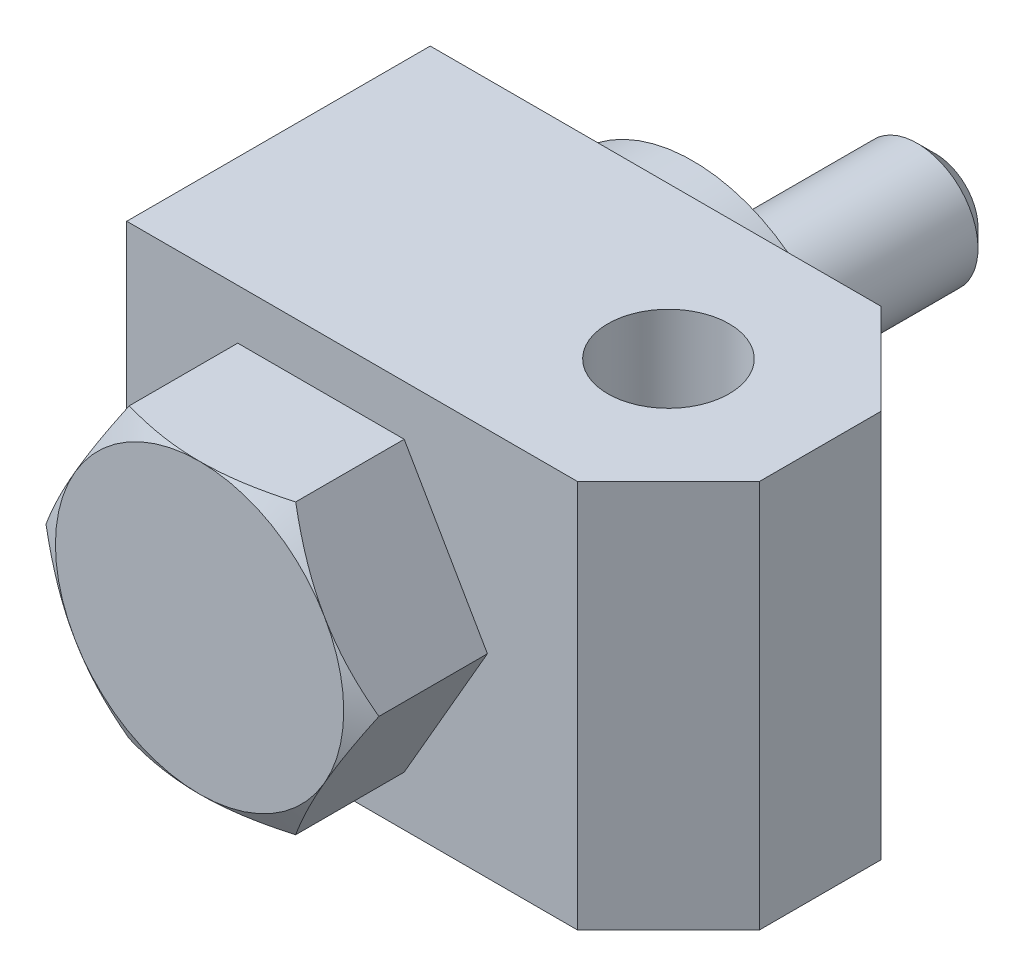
ISO-10303-21;
HEADER;
FILE_DESCRIPTION(('STEP AP214'),'2;1');
FILE_NAME('part.step','',(''),(''),'','','');
FILE_SCHEMA(('AUTOMOTIVE_DESIGN { 1 0 10303 214 1 1 1 1 }'));
ENDSEC;
DATA;
#1=APPLICATION_CONTEXT('core data for automotive mechanical design processes');
#2=APPLICATION_PROTOCOL_DEFINITION('international standard','automotive_design',2000,#1);
#3=PRODUCT_CONTEXT('',#1,'mechanical');
#4=PRODUCT('Part','Part','',(#3));
#5=PRODUCT_RELATED_PRODUCT_CATEGORY('part','',(#4));
#6=PRODUCT_DEFINITION_FORMATION('','',#4);
#7=PRODUCT_DEFINITION_CONTEXT('part definition',#1,'design');
#8=PRODUCT_DEFINITION('design','',#6,#7);
#9=PRODUCT_DEFINITION_SHAPE('','',#8);
#10=(LENGTH_UNIT() NAMED_UNIT(*) SI_UNIT(.MILLI.,.METRE.));
#11=(NAMED_UNIT(*) PLANE_ANGLE_UNIT() SI_UNIT($,.RADIAN.));
#12=(NAMED_UNIT(*) SI_UNIT($,.STERADIAN.) SOLID_ANGLE_UNIT());
#13=UNCERTAINTY_MEASURE_WITH_UNIT(LENGTH_MEASURE(1.E-05),#10,'distance_accuracy_value','');
#14=(GEOMETRIC_REPRESENTATION_CONTEXT(3) GLOBAL_UNCERTAINTY_ASSIGNED_CONTEXT((#13)) GLOBAL_UNIT_ASSIGNED_CONTEXT((#10,
#11,#12)) REPRESENTATION_CONTEXT('',''));
#15=CARTESIAN_POINT('',(0.,0.,0.));
#16=DIRECTION('',(0.,0.,1.));
#17=DIRECTION('',(1.,0.,0.));
#18=AXIS2_PLACEMENT_3D('',#15,#16,#17);
#19=CARTESIAN_POINT('',(0.,0.,-16.4));
#20=DIRECTION('',(0.,0.,1.));
#21=DIRECTION('',(0.,-1.,0.));
#22=AXIS2_PLACEMENT_3D('',#19,#20,#21);
#23=CYLINDRICAL_SURFACE('',#22,4.);
#24=CARTESIAN_POINT('',(0.,0.,-14.8));
#25=DIRECTION('',(0.,0.,-1.));
#26=DIRECTION('',(-1.,0.,0.));
#27=AXIS2_PLACEMENT_3D('',#24,#25,#26);
#28=CIRCLE('',#27,4.);
#29=CARTESIAN_POINT('',(-4.,0.,-14.8));
#30=VERTEX_POINT('',#29);
#31=EDGE_CURVE('E9',#30,#30,#28,.F.);
#32=ORIENTED_EDGE('',*,*,#31,.T.);
#33=EDGE_LOOP('',(#32));
#34=FACE_BOUND('',#33,.T.);
#35=CARTESIAN_POINT('',(0.,0.,0.));
#36=DIRECTION('',(0.,0.,1.));
#37=DIRECTION('',(0.,-1.,0.));
#38=AXIS2_PLACEMENT_3D('',#35,#36,#37);
#39=CIRCLE('',#38,4.);
#40=CARTESIAN_POINT('',(0.,-4.,0.));
#41=VERTEX_POINT('',#40);
#42=EDGE_CURVE('E294',#41,#41,#39,.F.);
#43=ORIENTED_EDGE('',*,*,#42,.T.);
#44=EDGE_LOOP('',(#43));
#45=FACE_BOUND('',#44,.T.);
#46=ADVANCED_FACE('F14',(#34,#45),#23,.T.);
#47=CARTESIAN_POINT('',(10.9696551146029,0.,-9.70548256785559));
#48=DIRECTION('',(0.866025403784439,0.5,0.));
#49=DIRECTION('',(-0.5,0.866025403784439,0.));
#50=AXIS2_PLACEMENT_3D('',#47,#48,#49);
#51=PLANE('',#50);
#52=DIRECTION('',(0.,0.,1.));
#53=VECTOR('',#52,1.);
#54=CARTESIAN_POINT('',(5.48482755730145,9.5,-9.70548256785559));
#55=LINE('',#54,#53);
#56=CARTESIAN_POINT('',(5.48482755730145,9.5,24.5));
#57=VERTEX_POINT('',#56);
#58=CARTESIAN_POINT('',(5.48482755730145,9.5,31.6514942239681));
#59=VERTEX_POINT('',#58);
#60=EDGE_CURVE('E226',#57,#59,#55,.T.);
#61=ORIENTED_EDGE('',*,*,#60,.T.);
#62=CARTESIAN_POINT('',(5.48471208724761,9.5002,31.6514275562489));
#63=CARTESIAN_POINT('',(5.60528058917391,9.2913692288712,31.7210265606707));
#64=CARTESIAN_POINT('',(5.72629863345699,9.08175982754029,31.7874666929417));
#65=CARTESIAN_POINT('',(5.96930519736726,8.66086011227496,31.9131527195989));
#66=CARTESIAN_POINT('',(6.09129402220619,8.44956926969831,31.9723962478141));
#67=CARTESIAN_POINT('',(6.45922610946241,7.81229220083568,32.1381854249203));
#68=CARTESIAN_POINT('',(6.70662183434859,7.38379023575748,32.2324855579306));
#69=CARTESIAN_POINT('',(7.07683821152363,6.74255666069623,32.3430612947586));
#70=CARTESIAN_POINT('',(7.19855281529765,6.53174078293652,32.3745601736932));
#71=CARTESIAN_POINT('',(7.44254555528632,6.10913296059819,32.427381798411));
#72=CARTESIAN_POINT('',(7.56482370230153,5.89734099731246,32.4487043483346));
#73=CARTESIAN_POINT('',(7.80958396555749,5.47340378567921,32.4806269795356));
#74=CARTESIAN_POINT('',(7.93206566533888,5.26125925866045,32.4912398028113));
#75=CARTESIAN_POINT('',(8.17714220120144,4.83677424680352,32.5015174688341));
#76=CARTESIAN_POINT('',(8.29973703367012,4.62443376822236,32.5011826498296));
#77=CARTESIAN_POINT('',(8.52893109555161,4.22745800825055,32.4903266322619));
#78=CARTESIAN_POINT('',(8.63554650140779,4.04279470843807,32.4811297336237));
#79=CARTESIAN_POINT('',(8.84852796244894,3.67389999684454,32.4546346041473));
#80=CARTESIAN_POINT('',(8.95489399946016,3.48966861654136,32.4373358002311));
#81=CARTESIAN_POINT('',(9.27357996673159,2.937688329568,32.3736955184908));
#82=CARTESIAN_POINT('',(9.48533580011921,2.57091646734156,32.3156180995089));
#83=CARTESIAN_POINT('',(9.91109368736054,1.83348217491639,32.1704239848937));
#84=CARTESIAN_POINT('',(10.1250414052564,1.46291385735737,32.0826918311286));
#85=CARTESIAN_POINT('',(10.5497463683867,0.727303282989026,31.8835762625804));
#86=CARTESIAN_POINT('',(10.7605090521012,0.362251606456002,31.7722396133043));
#87=CARTESIAN_POINT('',(10.9697705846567,-0.00019999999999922,31.6514275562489));
#88=B_SPLINE_CURVE_WITH_KNOTS('',3,(#62,#63,#64,#65,#66,#67,#68,#69,#70,#71,#72,#73,#74,#75,#76,
#77,#78,#79,#80,#81,#82,#83,#84,#85,#86,#87),.UNSPECIFIED.,.F.,.F.,(4,2,2,2,2,2,2,2,2,2,2,2,4),
(0.,0.752880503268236,1.50600787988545,3.01546870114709,3.75167336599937,4.48789219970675,
5.22323407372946,5.95855322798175,6.5986808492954,7.23885375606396,8.52010929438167,
9.82978009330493,11.1368800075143),.UNSPECIFIED.);
#89=CARTESIAN_POINT('',(8.22724133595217,4.75,32.5));
#90=VERTEX_POINT('',#89);
#91=EDGE_CURVE('E227',#59,#90,#88,.T.);
#92=ORIENTED_EDGE('',*,*,#91,.T.);
#93=CARTESIAN_POINT('',(10.9696551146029,0.,31.6514942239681));
#94=VERTEX_POINT('',#93);
#95=EDGE_CURVE('E131',#90,#94,#88,.T.);
#96=ORIENTED_EDGE('',*,*,#95,.T.);
#97=DIRECTION('',(0.,0.,1.));
#98=VECTOR('',#97,1.);
#99=CARTESIAN_POINT('',(10.9696551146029,0.,-9.70548256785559));
#100=LINE('',#99,#98);
#101=CARTESIAN_POINT('',(10.9696551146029,0.,24.5));
#102=VERTEX_POINT('',#101);
#103=EDGE_CURVE('E148',#102,#94,#100,.T.);
#104=ORIENTED_EDGE('',*,*,#103,.F.);
#105=DIRECTION('',(0.5,-0.866025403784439,0.));
#106=VECTOR('',#105,1.);
#107=CARTESIAN_POINT('',(10.9696551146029,0.,24.5));
#108=LINE('',#107,#106);
#109=EDGE_CURVE('E229',#57,#102,#108,.T.);
#110=ORIENTED_EDGE('',*,*,#109,.F.);
#111=EDGE_LOOP('',(#61,#92,#96,#104,#110));
#112=FACE_BOUND('',#111,.T.);
#113=ADVANCED_FACE('F212',(#112),#51,.T.);
#114=CARTESIAN_POINT('',(5.48482755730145,9.5,-9.70548256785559));
#115=DIRECTION('',(0.,1.,0.));
#116=DIRECTION('',(0.,0.,1.));
#117=AXIS2_PLACEMENT_3D('',#114,#115,#116);
#118=PLANE('',#117);
#119=DIRECTION('',(0.,0.,1.));
#120=VECTOR('',#119,1.);
#121=CARTESIAN_POINT('',(-5.48482755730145,9.5,-9.70548256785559));
#122=LINE('',#121,#120);
#123=CARTESIAN_POINT('',(-5.48482755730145,9.5,24.5));
#124=VERTEX_POINT('',#123);
#125=CARTESIAN_POINT('',(-5.48482755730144,9.5,31.6514942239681));
#126=VERTEX_POINT('',#125);
#127=EDGE_CURVE('E231',#124,#126,#122,.T.);
#128=ORIENTED_EDGE('',*,*,#127,.T.);
#129=CARTESIAN_POINT('',(-14.7239130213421,9.5,27.8681150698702));
#130=CARTESIAN_POINT('',(-14.5164985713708,9.5,27.9687370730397));
#131=CARTESIAN_POINT('',(-14.3088404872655,9.5,28.0688566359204));
#132=CARTESIAN_POINT('',(-13.8929862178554,9.5,28.2679770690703));
#133=CARTESIAN_POINT('',(-13.6847900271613,9.5,28.3669779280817));
#134=CARTESIAN_POINT('',(-13.059262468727,9.5,28.6621578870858));
#135=CARTESIAN_POINT('',(-12.6410536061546,9.5,28.8564844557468));
#136=CARTESIAN_POINT('',(-11.7995539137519,9.5,29.2400689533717));
#137=CARTESIAN_POINT('',(-11.3762478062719,9.5,29.4292934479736));
#138=CARTESIAN_POINT('',(-10.5262664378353,9.5,29.7999900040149));
#139=CARTESIAN_POINT('',(-10.0995913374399,9.5,29.9814624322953));
#140=CARTESIAN_POINT('',(-9.22843706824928,9.5,30.3402685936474));
#141=CARTESIAN_POINT('',(-8.78382568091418,9.5,30.5172830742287));
#142=CARTESIAN_POINT('',(-7.88939899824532,9.5,30.8578933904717));
#143=CARTESIAN_POINT('',(-7.43958312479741,9.5,31.021487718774));
#144=CARTESIAN_POINT('',(-6.53487124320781,9.5,31.3309555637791));
#145=CARTESIAN_POINT('',(-6.07998766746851,9.5,31.4768650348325));
#146=CARTESIAN_POINT('',(-5.16371170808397,9.5,31.7462771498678));
#147=CARTESIAN_POINT('',(-4.7023214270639,9.5,31.8697868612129));
#148=CARTESIAN_POINT('',(-3.77526223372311,9.5,32.0877991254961));
#149=CARTESIAN_POINT('',(-3.30963139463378,9.5,32.1824592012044));
#150=CARTESIAN_POINT('',(-2.60695203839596,9.5,32.29871172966));
#151=CARTESIAN_POINT('',(-2.37200270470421,9.5,32.3331745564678));
#152=CARTESIAN_POINT('',(-1.90093925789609,9.5,32.3928448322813));
#153=CARTESIAN_POINT('',(-1.66482525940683,9.5,32.4180531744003));
#154=CARTESIAN_POINT('',(-1.19482901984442,9.5,32.4583966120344));
#155=CARTESIAN_POINT('',(-0.960957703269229,9.5,32.4736584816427));
#156=CARTESIAN_POINT('',(-0.492779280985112,9.5,32.4942793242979));
#157=CARTESIAN_POINT('',(-0.258472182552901,9.5,32.4996384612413));
#158=CARTESIAN_POINT('',(0.210158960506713,9.5,32.5003260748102));
#159=CARTESIAN_POINT('',(0.444483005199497,9.5,32.4956545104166));
#160=CARTESIAN_POINT('',(0.912726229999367,9.5,32.4763945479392));
#161=CARTESIAN_POINT('',(1.14664539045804,9.5,32.461805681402));
#162=CARTESIAN_POINT('',(1.70910799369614,9.5,32.4151119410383));
#163=CARTESIAN_POINT('',(2.03726637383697,9.5,32.3782859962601));
#164=CARTESIAN_POINT('',(2.69114358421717,9.5,32.2871241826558));
#165=CARTESIAN_POINT('',(3.01686207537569,9.5,32.232785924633));
#166=CARTESIAN_POINT('',(3.66555075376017,9.5,32.1085325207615));
#167=CARTESIAN_POINT('',(3.98851858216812,9.5,32.038605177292));
#168=CARTESIAN_POINT('',(4.63121235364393,9.5,31.8853071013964));
#169=CARTESIAN_POINT('',(4.95093834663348,9.5,31.8019365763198));
#170=CARTESIAN_POINT('',(5.59415346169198,9.5,31.6218171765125));
#171=CARTESIAN_POINT('',(5.91757109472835,9.5,31.5248147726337));
#172=CARTESIAN_POINT('',(6.56122031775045,9.5,31.3208135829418));
#173=CARTESIAN_POINT('',(6.88145188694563,9.5,31.2138147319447));
#174=CARTESIAN_POINT('',(7.51888749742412,9.5,30.9915172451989));
#175=CARTESIAN_POINT('',(7.83609251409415,9.5,30.8762213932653));
#176=CARTESIAN_POINT('',(8.4678760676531,9.5,30.6386837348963));
#177=CARTESIAN_POINT('',(8.78245463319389,9.5,30.5164420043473));
#178=CARTESIAN_POINT('',(9.51602495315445,9.5,30.2235452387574));
#179=CARTESIAN_POINT('',(9.93409266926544,9.5,30.0505796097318));
#180=CARTESIAN_POINT('',(10.7667356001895,9.5,29.6964134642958));
#181=CARTESIAN_POINT('',(11.181310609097,9.5,29.5152124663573));
#182=CARTESIAN_POINT('',(12.007606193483,9.5,29.1461993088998));
#183=CARTESIAN_POINT('',(12.4193261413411,9.5,28.9583857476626));
#184=CARTESIAN_POINT('',(13.2402914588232,9.5,28.5774600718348));
#185=CARTESIAN_POINT('',(13.6495368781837,9.5,28.3843480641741));
#186=CARTESIAN_POINT('',(14.4663895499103,9.5,27.9935969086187));
#187=CARTESIAN_POINT('',(14.8739946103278,9.5,27.7959531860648));
#188=CARTESIAN_POINT('',(15.6874534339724,9.5,27.3970956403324));
#189=CARTESIAN_POINT('',(16.093307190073,9.5,27.1958818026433));
#190=CARTESIAN_POINT('',(17.3085546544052,9.5,26.5878712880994));
#191=CARTESIAN_POINT('',(18.1157374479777,9.5,26.1766559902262));
#192=CARTESIAN_POINT('',(19.6596496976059,9.5,25.3800321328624));
#193=CARTESIAN_POINT('',(20.3967189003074,9.5,24.9952791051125));
#194=CARTESIAN_POINT('',(21.8680945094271,9.5,24.2204700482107));
#195=CARTESIAN_POINT('',(22.6024008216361,9.5,23.8304138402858));
#196=CARTESIAN_POINT('',(24.0670703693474,9.5,23.0472060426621));
#197=CARTESIAN_POINT('',(24.7974388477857,9.5,22.6540642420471));
#198=CARTESIAN_POINT('',(26.2564037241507,9.5,21.8645980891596));
#199=CARTESIAN_POINT('',(26.9850002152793,9.5,21.4682739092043));
#200=CARTESIAN_POINT('',(27.7129419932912,9.5,21.0707589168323));
#201=B_SPLINE_CURVE_WITH_KNOTS('',3,(#129,#130,#131,#132,#133,#134,#135,#136,#137,#138,#139,
#140,#141,#142,#143,#144,#145,#146,#147,#148,#149,#150,#151,#152,#153,#154,#155,#156,#157,#158,
#159,#160,#161,#162,#163,#164,#165,#166,#167,#168,#169,#170,#171,#172,#173,#174,#175,#176,#177,
#178,#179,#180,#181,#182,#183,#184,#185,#186,#187,#188,#189,#190,#191,#192,#193,#194,#195,#196,
#197,#198,#199,#200),.UNSPECIFIED.,.F.,.F.,(4,2,2,2,2,2,2,2,2,2,2,2,2,2,2,2,2,2,2,2,2,2,2,2,2,2,
2,2,2,2,2,2,2,2,2,4),(0.,0.691598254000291,1.38320346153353,2.766619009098,4.15758154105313,
5.54847817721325,6.98397054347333,8.41962392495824,9.85230775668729,11.284538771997,
12.7088034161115,13.4210400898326,14.1332080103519,14.8361115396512,15.5390034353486,
16.241898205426,16.9448261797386,17.9349327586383,18.9251744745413,19.916193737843,
20.9071977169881,21.9199585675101,22.932726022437,23.9451552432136,24.9575734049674,
26.3147606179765,27.6720272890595,29.0295834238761,30.3871121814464,31.7460775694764,
33.1050484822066,35.8226476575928,38.3169688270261,40.8113742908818,43.2997363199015,
45.7879645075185),.UNSPECIFIED.);
#202=CARTESIAN_POINT('',(0.,9.5,32.5));
#203=VERTEX_POINT('',#202);
#204=EDGE_CURVE('E200',#126,#203,#201,.T.);
#205=ORIENTED_EDGE('',*,*,#204,.T.);
#206=EDGE_CURVE('E193',#203,#59,#201,.T.);
#207=ORIENTED_EDGE('',*,*,#206,.T.);
#208=ORIENTED_EDGE('',*,*,#60,.F.);
#209=DIRECTION('',(1.,0.,0.));
#210=VECTOR('',#209,1.);
#211=CARTESIAN_POINT('',(5.48482755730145,9.5,24.5));
#212=LINE('',#211,#210);
#213=EDGE_CURVE('E246',#124,#57,#212,.T.);
#214=ORIENTED_EDGE('',*,*,#213,.F.);
#215=EDGE_LOOP('',(#128,#205,#207,#208,#214));
#216=FACE_BOUND('',#215,.T.);
#217=ADVANCED_FACE('F208',(#216),#118,.T.);
#218=CARTESIAN_POINT('',(-5.48482755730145,9.5,-9.70548256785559));
#219=DIRECTION('',(-0.866025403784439,0.5,0.));
#220=DIRECTION('',(-0.5,-0.866025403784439,0.));
#221=AXIS2_PLACEMENT_3D('',#218,#219,#220);
#222=PLANE('',#221);
#223=DIRECTION('',(0.,0.,1.));
#224=VECTOR('',#223,1.);
#225=CARTESIAN_POINT('',(-10.9696551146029,0.,-9.70548256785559));
#226=LINE('',#225,#224);
#227=CARTESIAN_POINT('',(-10.9696551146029,0.,24.5));
#228=VERTEX_POINT('',#227);
#229=CARTESIAN_POINT('',(-10.9696551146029,0.,31.6514942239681));
#230=VERTEX_POINT('',#229);
#231=EDGE_CURVE('E234',#228,#230,#226,.T.);
#232=ORIENTED_EDGE('',*,*,#231,.T.);
#233=CARTESIAN_POINT('',(-10.9697705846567,-0.000199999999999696,31.6514275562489));
#234=CARTESIAN_POINT('',(-10.8492020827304,0.208630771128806,31.7210265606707));
#235=CARTESIAN_POINT('',(-10.7281840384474,0.418240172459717,31.7874666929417));
#236=CARTESIAN_POINT('',(-10.4851774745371,0.839139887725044,31.9131527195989));
#237=CARTESIAN_POINT('',(-10.3631886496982,1.05043073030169,31.9723962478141));
#238=CARTESIAN_POINT('',(-9.99525656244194,1.68770779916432,32.1381854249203));
#239=CARTESIAN_POINT('',(-9.74786083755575,2.11620976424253,32.2324855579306));
#240=CARTESIAN_POINT('',(-9.37764446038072,2.75744333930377,32.3430612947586));
#241=CARTESIAN_POINT('',(-9.2559298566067,2.96825921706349,32.3745601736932));
#242=CARTESIAN_POINT('',(-9.01193711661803,3.39086703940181,32.427381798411));
#243=CARTESIAN_POINT('',(-8.88965896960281,3.60265900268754,32.4487043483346));
#244=CARTESIAN_POINT('',(-8.64489870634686,4.02659621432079,32.4806269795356));
#245=CARTESIAN_POINT('',(-8.52241700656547,4.23874074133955,32.4912398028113));
#246=CARTESIAN_POINT('',(-8.27734047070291,4.66322575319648,32.5015174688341));
#247=CARTESIAN_POINT('',(-8.15474563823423,4.87556623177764,32.5011826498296));
#248=CARTESIAN_POINT('',(-7.92555157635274,5.27254199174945,32.4903266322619));
#249=CARTESIAN_POINT('',(-7.81893617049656,5.45720529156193,32.4811297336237));
#250=CARTESIAN_POINT('',(-7.60595470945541,5.82610000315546,32.4546346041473));
#251=CARTESIAN_POINT('',(-7.49958867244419,6.01033138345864,32.4373358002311));
#252=CARTESIAN_POINT('',(-7.18090270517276,6.562311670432,32.3736955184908));
#253=CARTESIAN_POINT('',(-6.96914687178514,6.92908353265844,32.3156180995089));
#254=CARTESIAN_POINT('',(-6.54338898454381,7.66651782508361,32.1704239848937));
#255=CARTESIAN_POINT('',(-6.32944126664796,8.03708614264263,32.0826918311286));
#256=CARTESIAN_POINT('',(-5.90473630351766,8.77269671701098,31.8835762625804));
#257=CARTESIAN_POINT('',(-5.69397361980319,9.137748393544,31.7722396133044));
#258=CARTESIAN_POINT('',(-5.48471208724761,9.5002,31.6514275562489));
#259=B_SPLINE_CURVE_WITH_KNOTS('',3,(#233,#234,#235,#236,#237,#238,#239,#240,#241,#242,#243,
#244,#245,#246,#247,#248,#249,#250,#251,#252,#253,#254,#255,#256,#257,#258),.UNSPECIFIED.,.F.,
.F.,(4,2,2,2,2,2,2,2,2,2,2,2,4),(0.,0.752880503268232,1.50600787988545,3.01546870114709,
3.75167336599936,4.48789219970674,5.22323407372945,5.95855322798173,6.59868084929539,
7.23885375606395,8.52010929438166,9.82978009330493,11.1368800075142),.UNSPECIFIED.);
#260=CARTESIAN_POINT('',(-8.22724133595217,4.75,32.5));
#261=VERTEX_POINT('',#260);
#262=EDGE_CURVE('E236',#230,#261,#259,.T.);
#263=ORIENTED_EDGE('',*,*,#262,.T.);
#264=EDGE_CURVE('E201',#261,#126,#259,.T.);
#265=ORIENTED_EDGE('',*,*,#264,.T.);
#266=ORIENTED_EDGE('',*,*,#127,.F.);
#267=DIRECTION('',(0.5,0.866025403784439,0.));
#268=VECTOR('',#267,1.);
#269=CARTESIAN_POINT('',(-5.48482755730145,9.5,24.5));
#270=LINE('',#269,#268);
#271=EDGE_CURVE('E392',#228,#124,#270,.T.);
#272=ORIENTED_EDGE('',*,*,#271,.F.);
#273=EDGE_LOOP('',(#232,#263,#265,#266,#272));
#274=FACE_BOUND('',#273,.T.);
#275=ADVANCED_FACE('F211',(#274),#222,.T.);
#276=CARTESIAN_POINT('',(-10.9696551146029,0.,-9.70548256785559));
#277=DIRECTION('',(-0.866025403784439,-0.5,0.));
#278=DIRECTION('',(0.5,-0.866025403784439,0.));
#279=AXIS2_PLACEMENT_3D('',#276,#277,#278);
#280=PLANE('',#279);
#281=DIRECTION('',(0.,0.,1.));
#282=VECTOR('',#281,1.);
#283=CARTESIAN_POINT('',(-5.48482755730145,-9.5,-9.70548256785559));
#284=LINE('',#283,#282);
#285=CARTESIAN_POINT('',(-5.48482755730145,-9.5,24.5));
#286=VERTEX_POINT('',#285);
#287=CARTESIAN_POINT('',(-5.48482755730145,-9.5,31.6514942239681));
#288=VERTEX_POINT('',#287);
#289=EDGE_CURVE('E402',#286,#288,#284,.T.);
#290=ORIENTED_EDGE('',*,*,#289,.T.);
#291=CARTESIAN_POINT('',(-5.48471208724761,-9.5002,31.6514275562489));
#292=CARTESIAN_POINT('',(-5.60528058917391,-9.2913692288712,31.7210265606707));
#293=CARTESIAN_POINT('',(-5.72629863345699,-9.08175982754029,31.7874666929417));
#294=CARTESIAN_POINT('',(-5.96930519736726,-8.66086011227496,31.9131527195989));
#295=CARTESIAN_POINT('',(-6.09129402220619,-8.44956926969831,31.9723962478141));
#296=CARTESIAN_POINT('',(-6.4592261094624,-7.81229220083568,32.1381854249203));
#297=CARTESIAN_POINT('',(-6.70662183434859,-7.38379023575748,32.2324855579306));
#298=CARTESIAN_POINT('',(-7.07683821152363,-6.74255666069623,32.3430612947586));
#299=CARTESIAN_POINT('',(-7.19855281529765,-6.53174078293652,32.3745601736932));
#300=CARTESIAN_POINT('',(-7.44254555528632,-6.10913296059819,32.427381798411));
#301=CARTESIAN_POINT('',(-7.56482370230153,-5.89734099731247,32.4487043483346));
#302=CARTESIAN_POINT('',(-7.80958396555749,-5.47340378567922,32.4806269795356));
#303=CARTESIAN_POINT('',(-7.93206566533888,-5.26125925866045,32.4912398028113));
#304=CARTESIAN_POINT('',(-8.17714220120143,-4.83677424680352,32.5015174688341));
#305=CARTESIAN_POINT('',(-8.29973703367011,-4.62443376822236,32.5011826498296));
#306=CARTESIAN_POINT('',(-8.5289310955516,-4.22745800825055,32.4903266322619));
#307=CARTESIAN_POINT('',(-8.63554650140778,-4.04279470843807,32.4811297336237));
#308=CARTESIAN_POINT('',(-8.84852796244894,-3.67389999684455,32.4546346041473));
#309=CARTESIAN_POINT('',(-8.95489399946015,-3.48966861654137,32.4373358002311));
#310=CARTESIAN_POINT('',(-9.27357996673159,-2.93768832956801,32.3736955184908));
#311=CARTESIAN_POINT('',(-9.4853358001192,-2.57091646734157,32.3156180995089));
#312=CARTESIAN_POINT('',(-9.91109368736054,-1.8334821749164,32.1704239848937));
#313=CARTESIAN_POINT('',(-10.1250414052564,-1.46291385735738,32.0826918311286));
#314=CARTESIAN_POINT('',(-10.5497463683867,-0.727303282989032,31.8835762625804));
#315=CARTESIAN_POINT('',(-10.7605090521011,-0.362251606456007,31.7722396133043));
#316=CARTESIAN_POINT('',(-10.9697705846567,0.000200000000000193,31.6514275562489));
#317=B_SPLINE_CURVE_WITH_KNOTS('',3,(#291,#292,#293,#294,#295,#296,#297,#298,#299,#300,#301,
#302,#303,#304,#305,#306,#307,#308,#309,#310,#311,#312,#313,#314,#315,#316),.UNSPECIFIED.,.F.,
.F.,(4,2,2,2,2,2,2,2,2,2,2,2,4),(0.,0.752880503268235,1.50600787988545,3.01546870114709,
3.75167336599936,4.48789219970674,5.22323407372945,5.95855322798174,6.59868084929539,
7.23885375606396,8.52010929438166,9.82978009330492,11.1368800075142),.UNSPECIFIED.);
#318=CARTESIAN_POINT('',(-8.22724133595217,-4.75,32.5));
#319=VERTEX_POINT('',#318);
#320=EDGE_CURVE('E187',#288,#319,#317,.T.);
#321=ORIENTED_EDGE('',*,*,#320,.T.);
#322=EDGE_CURVE('E414',#319,#230,#317,.T.);
#323=ORIENTED_EDGE('',*,*,#322,.T.);
#324=ORIENTED_EDGE('',*,*,#231,.F.);
#325=DIRECTION('',(-0.5,0.866025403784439,0.));
#326=VECTOR('',#325,1.);
#327=CARTESIAN_POINT('',(-10.9696551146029,0.,24.5));
#328=LINE('',#327,#326);
#329=EDGE_CURVE('E394',#286,#228,#328,.T.);
#330=ORIENTED_EDGE('',*,*,#329,.F.);
#331=EDGE_LOOP('',(#290,#321,#323,#324,#330));
#332=FACE_BOUND('',#331,.T.);
#333=ADVANCED_FACE('F411',(#332),#280,.T.);
#334=CARTESIAN_POINT('',(-5.48482755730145,-9.5,-9.70548256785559));
#335=DIRECTION('',(0.,-1.,0.));
#336=DIRECTION('',(0.,0.,-1.));
#337=AXIS2_PLACEMENT_3D('',#334,#335,#336);
#338=PLANE('',#337);
#339=DIRECTION('',(0.,0.,1.));
#340=VECTOR('',#339,1.);
#341=CARTESIAN_POINT('',(5.48482755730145,-9.5,-9.70548256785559));
#342=LINE('',#341,#340);
#343=CARTESIAN_POINT('',(5.48482755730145,-9.5,24.5));
#344=VERTEX_POINT('',#343);
#345=CARTESIAN_POINT('',(5.48482755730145,-9.5,31.6514942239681));
#346=VERTEX_POINT('',#345);
#347=EDGE_CURVE('E242',#344,#346,#342,.T.);
#348=ORIENTED_EDGE('',*,*,#347,.T.);
#349=CARTESIAN_POINT('',(-14.7239130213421,-9.5,27.8681150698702));
#350=CARTESIAN_POINT('',(-14.5164985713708,-9.5,27.9687370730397));
#351=CARTESIAN_POINT('',(-14.3088404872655,-9.5,28.0688566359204));
#352=CARTESIAN_POINT('',(-13.8929862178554,-9.5,28.2679770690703));
#353=CARTESIAN_POINT('',(-13.6847900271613,-9.5,28.3669779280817));
#354=CARTESIAN_POINT('',(-13.059262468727,-9.5,28.6621578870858));
#355=CARTESIAN_POINT('',(-12.6410536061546,-9.5,28.8564844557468));
#356=CARTESIAN_POINT('',(-11.7995539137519,-9.5,29.2400689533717));
#357=CARTESIAN_POINT('',(-11.3762478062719,-9.5,29.4292934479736));
#358=CARTESIAN_POINT('',(-10.5262664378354,-9.5,29.7999900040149));
#359=CARTESIAN_POINT('',(-10.0995913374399,-9.5,29.9814624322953));
#360=CARTESIAN_POINT('',(-9.22843706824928,-9.5,30.3402685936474));
#361=CARTESIAN_POINT('',(-8.78382568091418,-9.5,30.5172830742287));
#362=CARTESIAN_POINT('',(-7.88939899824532,-9.5,30.8578933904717));
#363=CARTESIAN_POINT('',(-7.43958312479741,-9.5,31.021487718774));
#364=CARTESIAN_POINT('',(-6.53487124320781,-9.5,31.3309555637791));
#365=CARTESIAN_POINT('',(-6.0799876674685,-9.5,31.4768650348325));
#366=CARTESIAN_POINT('',(-5.16371170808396,-9.5,31.7462771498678));
#367=CARTESIAN_POINT('',(-4.70232142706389,-9.5,31.8697868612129));
#368=CARTESIAN_POINT('',(-3.7752622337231,-9.5,32.0877991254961));
#369=CARTESIAN_POINT('',(-3.30963139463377,-9.5,32.1824592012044));
#370=CARTESIAN_POINT('',(-2.60695203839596,-9.5,32.29871172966));
#371=CARTESIAN_POINT('',(-2.37200270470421,-9.5,32.3331745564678));
#372=CARTESIAN_POINT('',(-1.90093925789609,-9.5,32.3928448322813));
#373=CARTESIAN_POINT('',(-1.66482525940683,-9.5,32.4180531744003));
#374=CARTESIAN_POINT('',(-1.19482901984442,-9.5,32.4583966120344));
#375=CARTESIAN_POINT('',(-0.960957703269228,-9.5,32.4736584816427));
#376=CARTESIAN_POINT('',(-0.492779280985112,-9.5,32.4942793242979));
#377=CARTESIAN_POINT('',(-0.258472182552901,-9.5,32.4996384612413));
#378=CARTESIAN_POINT('',(0.210158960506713,-9.5,32.5003260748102));
#379=CARTESIAN_POINT('',(0.444483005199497,-9.5,32.4956545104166));
#380=CARTESIAN_POINT('',(0.912726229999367,-9.5,32.4763945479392));
#381=CARTESIAN_POINT('',(1.14664539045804,-9.5,32.461805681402));
#382=CARTESIAN_POINT('',(1.70910799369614,-9.5,32.4151119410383));
#383=CARTESIAN_POINT('',(2.03726637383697,-9.5,32.3782859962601));
#384=CARTESIAN_POINT('',(2.69114358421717,-9.5,32.2871241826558));
#385=CARTESIAN_POINT('',(3.01686207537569,-9.5,32.232785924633));
#386=CARTESIAN_POINT('',(3.66555075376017,-9.5,32.1085325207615));
#387=CARTESIAN_POINT('',(3.98851858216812,-9.5,32.038605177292));
#388=CARTESIAN_POINT('',(4.63121235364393,-9.5,31.8853071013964));
#389=CARTESIAN_POINT('',(4.95093834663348,-9.5,31.8019365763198));
#390=CARTESIAN_POINT('',(5.59415346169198,-9.5,31.6218171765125));
#391=CARTESIAN_POINT('',(5.91757109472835,-9.5,31.5248147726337));
#392=CARTESIAN_POINT('',(6.56122031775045,-9.5,31.3208135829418));
#393=CARTESIAN_POINT('',(6.88145188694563,-9.5,31.2138147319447));
#394=CARTESIAN_POINT('',(7.51888749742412,-9.5,30.9915172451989));
#395=CARTESIAN_POINT('',(7.83609251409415,-9.5,30.8762213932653));
#396=CARTESIAN_POINT('',(8.4678760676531,-9.5,30.6386837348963));
#397=CARTESIAN_POINT('',(8.78245463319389,-9.5,30.5164420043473));
#398=CARTESIAN_POINT('',(9.51602495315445,-9.5,30.2235452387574));
#399=CARTESIAN_POINT('',(9.93409266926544,-9.5,30.0505796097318));
#400=CARTESIAN_POINT('',(10.7667356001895,-9.5,29.6964134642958));
#401=CARTESIAN_POINT('',(11.181310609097,-9.5,29.5152124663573));
#402=CARTESIAN_POINT('',(12.007606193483,-9.5,29.1461993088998));
#403=CARTESIAN_POINT('',(12.4193261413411,-9.5,28.9583857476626));
#404=CARTESIAN_POINT('',(13.2402914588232,-9.5,28.5774600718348));
#405=CARTESIAN_POINT('',(13.6495368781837,-9.5,28.3843480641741));
#406=CARTESIAN_POINT('',(14.4663895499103,-9.5,27.9935969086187));
#407=CARTESIAN_POINT('',(14.8739946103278,-9.5,27.7959531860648));
#408=CARTESIAN_POINT('',(15.6874534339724,-9.5,27.3970956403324));
#409=CARTESIAN_POINT('',(16.093307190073,-9.5,27.1958818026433));
#410=CARTESIAN_POINT('',(17.3085546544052,-9.5,26.5878712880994));
#411=CARTESIAN_POINT('',(18.1157374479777,-9.5,26.1766559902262));
#412=CARTESIAN_POINT('',(19.6596496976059,-9.5,25.3800321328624));
#413=CARTESIAN_POINT('',(20.3967189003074,-9.5,24.9952791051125));
#414=CARTESIAN_POINT('',(21.8680945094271,-9.5,24.2204700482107));
#415=CARTESIAN_POINT('',(22.6024008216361,-9.5,23.8304138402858));
#416=CARTESIAN_POINT('',(24.0670703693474,-9.5,23.0472060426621));
#417=CARTESIAN_POINT('',(24.7974388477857,-9.5,22.6540642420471));
#418=CARTESIAN_POINT('',(26.2564037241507,-9.5,21.8645980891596));
#419=CARTESIAN_POINT('',(26.9850002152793,-9.5,21.4682739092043));
#420=CARTESIAN_POINT('',(27.7129419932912,-9.5,21.0707589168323));
#421=B_SPLINE_CURVE_WITH_KNOTS('',3,(#349,#350,#351,#352,#353,#354,#355,#356,#357,#358,#359,
#360,#361,#362,#363,#364,#365,#366,#367,#368,#369,#370,#371,#372,#373,#374,#375,#376,#377,#378,
#379,#380,#381,#382,#383,#384,#385,#386,#387,#388,#389,#390,#391,#392,#393,#394,#395,#396,#397,
#398,#399,#400,#401,#402,#403,#404,#405,#406,#407,#408,#409,#410,#411,#412,#413,#414,#415,#416,
#417,#418,#419,#420),.UNSPECIFIED.,.F.,.F.,(4,2,2,2,2,2,2,2,2,2,2,2,2,2,2,2,2,2,2,2,2,2,2,2,2,2,
2,2,2,2,2,2,2,2,2,4),(0.,0.691598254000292,1.38320346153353,2.766619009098,4.15758154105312,
5.54847817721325,6.98397054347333,8.41962392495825,9.8523077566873,11.284538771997,
12.7088034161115,13.4210400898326,14.133208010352,14.8361115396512,15.5390034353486,
16.241898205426,16.9448261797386,17.9349327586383,18.9251744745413,19.916193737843,
20.9071977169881,21.9199585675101,22.932726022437,23.9451552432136,24.9575734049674,
26.3147606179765,27.6720272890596,29.0295834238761,30.3871121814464,31.7460775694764,
33.1050484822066,35.8226476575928,38.3169688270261,40.8113742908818,43.2997363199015,
45.7879645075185),.UNSPECIFIED.);
#422=CARTESIAN_POINT('',(0.,-9.5,32.5));
#423=VERTEX_POINT('',#422);
#424=EDGE_CURVE('E33',#346,#423,#421,.F.);
#425=ORIENTED_EDGE('',*,*,#424,.T.);
#426=EDGE_CURVE('E150',#423,#288,#421,.F.);
#427=ORIENTED_EDGE('',*,*,#426,.T.);
#428=ORIENTED_EDGE('',*,*,#289,.F.);
#429=DIRECTION('',(-1.,0.,0.));
#430=VECTOR('',#429,1.);
#431=CARTESIAN_POINT('',(-5.48482755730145,-9.5,24.5));
#432=LINE('',#431,#430);
#433=EDGE_CURVE('E398',#344,#286,#432,.T.);
#434=ORIENTED_EDGE('',*,*,#433,.F.);
#435=EDGE_LOOP('',(#348,#425,#427,#428,#434));
#436=FACE_BOUND('',#435,.T.);
#437=ADVANCED_FACE('F173',(#436),#338,.T.);
#438=CARTESIAN_POINT('',(5.48482755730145,-9.5,-9.70548256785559));
#439=DIRECTION('',(0.866025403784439,-0.5,0.));
#440=DIRECTION('',(0.5,0.866025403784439,0.));
#441=AXIS2_PLACEMENT_3D('',#438,#439,#440);
#442=PLANE('',#441);
#443=ORIENTED_EDGE('',*,*,#103,.T.);
#444=CARTESIAN_POINT('',(10.9697705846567,0.000199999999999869,31.6514275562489));
#445=CARTESIAN_POINT('',(10.8492020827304,-0.208630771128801,31.7210265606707));
#446=CARTESIAN_POINT('',(10.7281840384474,-0.41824017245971,31.7874666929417));
#447=CARTESIAN_POINT('',(10.4851774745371,-0.839139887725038,31.9131527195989));
#448=CARTESIAN_POINT('',(10.3631886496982,-1.05043073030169,31.9723962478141));
#449=CARTESIAN_POINT('',(9.99525656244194,-1.68770779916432,32.1381854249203));
#450=CARTESIAN_POINT('',(9.74786083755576,-2.11620976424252,32.2324855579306));
#451=CARTESIAN_POINT('',(9.37764446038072,-2.75744333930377,32.3430612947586));
#452=CARTESIAN_POINT('',(9.2559298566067,-2.96825921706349,32.3745601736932));
#453=CARTESIAN_POINT('',(9.01193711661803,-3.39086703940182,32.427381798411));
#454=CARTESIAN_POINT('',(8.88965896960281,-3.60265900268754,32.4487043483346));
#455=CARTESIAN_POINT('',(8.64489870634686,-4.02659621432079,32.4806269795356));
#456=CARTESIAN_POINT('',(8.52241700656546,-4.23874074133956,32.4912398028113));
#457=CARTESIAN_POINT('',(8.27734047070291,-4.66322575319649,32.5015174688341));
#458=CARTESIAN_POINT('',(8.15474563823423,-4.87556623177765,32.5011826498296));
#459=CARTESIAN_POINT('',(7.92555157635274,-5.27254199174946,32.4903266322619));
#460=CARTESIAN_POINT('',(7.81893617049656,-5.45720529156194,32.4811297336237));
#461=CARTESIAN_POINT('',(7.60595470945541,-5.82610000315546,32.4546346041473));
#462=CARTESIAN_POINT('',(7.49958867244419,-6.01033138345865,32.4373358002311));
#463=CARTESIAN_POINT('',(7.18090270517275,-6.56231167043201,32.3736955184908));
#464=CARTESIAN_POINT('',(6.96914687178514,-6.92908353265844,32.3156180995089));
#465=CARTESIAN_POINT('',(6.54338898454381,-7.66651782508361,32.1704239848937));
#466=CARTESIAN_POINT('',(6.32944126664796,-8.03708614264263,32.0826918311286));
#467=CARTESIAN_POINT('',(5.90473630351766,-8.77269671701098,31.8835762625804));
#468=CARTESIAN_POINT('',(5.69397361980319,-9.137748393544,31.7722396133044));
#469=CARTESIAN_POINT('',(5.48471208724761,-9.5002,31.6514275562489));
#470=B_SPLINE_CURVE_WITH_KNOTS('',3,(#444,#445,#446,#447,#448,#449,#450,#451,#452,#453,#454,
#455,#456,#457,#458,#459,#460,#461,#462,#463,#464,#465,#466,#467,#468,#469),.UNSPECIFIED.,.F.,
.F.,(4,2,2,2,2,2,2,2,2,2,2,2,4),(0.,0.752880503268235,1.50600787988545,3.0154687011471,
3.75167336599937,4.48789219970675,5.22323407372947,5.95855322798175,6.59868084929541,
7.23885375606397,8.52010929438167,9.82978009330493,11.1368800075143),.UNSPECIFIED.);
#471=CARTESIAN_POINT('',(8.22724133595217,-4.75,32.5));
#472=VERTEX_POINT('',#471);
#473=EDGE_CURVE('E124',#94,#472,#470,.T.);
#474=ORIENTED_EDGE('',*,*,#473,.T.);
#475=EDGE_CURVE('E117',#472,#346,#470,.T.);
#476=ORIENTED_EDGE('',*,*,#475,.T.);
#477=ORIENTED_EDGE('',*,*,#347,.F.);
#478=DIRECTION('',(-0.5,-0.866025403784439,0.));
#479=VECTOR('',#478,1.);
#480=CARTESIAN_POINT('',(5.48482755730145,-9.5,24.5));
#481=LINE('',#480,#479);
#482=EDGE_CURVE('E241',#102,#344,#481,.T.);
#483=ORIENTED_EDGE('',*,*,#482,.F.);
#484=EDGE_LOOP('',(#443,#474,#476,#477,#483));
#485=FACE_BOUND('',#484,.T.);
#486=ADVANCED_FACE('F146',(#485),#442,.T.);
#487=CARTESIAN_POINT('',(0.,0.,0.));
#488=DIRECTION('',(0.,0.,1.));
#489=DIRECTION('',(0.,-1.,0.));
#490=AXIS2_PLACEMENT_3D('',#487,#488,#489);
#491=PLANE('',#490);
#492=CARTESIAN_POINT('',(0.,0.,0.));
#493=DIRECTION('',(0.,0.,1.));
#494=DIRECTION('',(0.,-1.,0.));
#495=AXIS2_PLACEMENT_3D('',#492,#493,#494);
#496=CIRCLE('',#495,10.4);
#497=CARTESIAN_POINT('',(0.,-10.4,0.));
#498=VERTEX_POINT('',#497);
#499=EDGE_CURVE('E268',#498,#498,#496,.T.);
#500=ORIENTED_EDGE('',*,*,#499,.F.);
#501=EDGE_LOOP('',(#500));
#502=FACE_BOUND('',#501,.T.);
#503=ORIENTED_EDGE('',*,*,#42,.F.);
#504=EDGE_LOOP('',(#503));
#505=FACE_BOUND('',#504,.T.);
#506=ADVANCED_FACE('F315',(#502,#505),#491,.F.);
#507=CARTESIAN_POINT('',(22.9,12.8,24.5));
#508=DIRECTION('',(0.,0.,1.));
#509=DIRECTION('',(0.,-1.,0.));
#510=AXIS2_PLACEMENT_3D('',#507,#508,#509);
#511=PLANE('',#510);
#512=DIRECTION('',(1.,0.,0.));
#513=VECTOR('',#512,1.);
#514=CARTESIAN_POINT('',(22.9,-12.8,24.5));
#515=LINE('',#514,#513);
#516=CARTESIAN_POINT('',(-12.8,-12.8,24.5));
#517=VERTEX_POINT('',#516);
#518=CARTESIAN_POINT('',(16.9,-12.8,24.5));
#519=VERTEX_POINT('',#518);
#520=EDGE_CURVE('E254',#517,#519,#515,.T.);
#521=ORIENTED_EDGE('',*,*,#520,.T.);
#522=DIRECTION('',(0.,1.,0.));
#523=VECTOR('',#522,1.);
#524=CARTESIAN_POINT('',(16.9,12.8,24.5));
#525=LINE('',#524,#523);
#526=CARTESIAN_POINT('',(16.9,12.8,24.5));
#527=VERTEX_POINT('',#526);
#528=EDGE_CURVE('E274',#519,#527,#525,.T.);
#529=ORIENTED_EDGE('',*,*,#528,.T.);
#530=DIRECTION('',(-1.,0.,0.));
#531=VECTOR('',#530,1.);
#532=CARTESIAN_POINT('',(22.9,12.8,24.5));
#533=LINE('',#532,#531);
#534=CARTESIAN_POINT('',(-12.8,12.8,24.5));
#535=VERTEX_POINT('',#534);
#536=EDGE_CURVE('E250',#527,#535,#533,.T.);
#537=ORIENTED_EDGE('',*,*,#536,.T.);
#538=DIRECTION('',(0.,-1.,0.));
#539=VECTOR('',#538,1.);
#540=CARTESIAN_POINT('',(-12.8,12.8,24.5));
#541=LINE('',#540,#539);
#542=EDGE_CURVE('E252',#535,#517,#541,.T.);
#543=ORIENTED_EDGE('',*,*,#542,.T.);
#544=EDGE_LOOP('',(#521,#529,#537,#543));
#545=FACE_BOUND('',#544,.T.);
#546=ORIENTED_EDGE('',*,*,#109,.T.);
#547=ORIENTED_EDGE('',*,*,#482,.T.);
#548=ORIENTED_EDGE('',*,*,#433,.T.);
#549=ORIENTED_EDGE('',*,*,#329,.T.);
#550=ORIENTED_EDGE('',*,*,#271,.T.);
#551=ORIENTED_EDGE('',*,*,#213,.T.);
#552=EDGE_LOOP('',(#546,#547,#548,#549,#550,#551));
#553=FACE_BOUND('',#552,.T.);
#554=ADVANCED_FACE('F317',(#545,#553),#511,.T.);
#555=CARTESIAN_POINT('',(0.,0.,4.5));
#556=DIRECTION('',(0.,0.,-1.));
#557=DIRECTION('',(0.,1.,0.));
#558=AXIS2_PLACEMENT_3D('',#555,#556,#557);
#559=CYLINDRICAL_SURFACE('',#558,10.4);
#560=CARTESIAN_POINT('',(0.,0.,4.5));
#561=DIRECTION('',(0.,0.,1.));
#562=DIRECTION('',(0.,-1.,0.));
#563=AXIS2_PLACEMENT_3D('',#560,#561,#562);
#564=CIRCLE('',#563,10.4);
#565=CARTESIAN_POINT('',(0.,-10.4,4.5));
#566=VERTEX_POINT('',#565);
#567=EDGE_CURVE('E271',#566,#566,#564,.T.);
#568=ORIENTED_EDGE('',*,*,#567,.F.);
#569=EDGE_LOOP('',(#568));
#570=FACE_BOUND('',#569,.T.);
#571=ORIENTED_EDGE('',*,*,#499,.T.);
#572=EDGE_LOOP('',(#571));
#573=FACE_BOUND('',#572,.T.);
#574=ADVANCED_FACE('F325',(#570,#573),#559,.T.);
#575=CARTESIAN_POINT('',(22.9,12.8,4.5));
#576=DIRECTION('',(0.,0.,1.));
#577=DIRECTION('',(0.,-1.,0.));
#578=AXIS2_PLACEMENT_3D('',#575,#576,#577);
#579=PLANE('',#578);
#580=DIRECTION('',(-1.,0.,0.));
#581=VECTOR('',#580,1.);
#582=CARTESIAN_POINT('',(22.9,12.8,4.5));
#583=LINE('',#582,#581);
#584=CARTESIAN_POINT('',(16.9,12.8,4.5));
#585=VERTEX_POINT('',#584);
#586=CARTESIAN_POINT('',(-12.8,12.8,4.5));
#587=VERTEX_POINT('',#586);
#588=EDGE_CURVE('E243',#585,#587,#583,.T.);
#589=ORIENTED_EDGE('',*,*,#588,.F.);
#590=DIRECTION('',(0.,-1.,0.));
#591=VECTOR('',#590,1.);
#592=CARTESIAN_POINT('',(16.9,12.8,4.5));
#593=LINE('',#592,#591);
#594=CARTESIAN_POINT('',(16.9,-12.8,4.5));
#595=VERTEX_POINT('',#594);
#596=EDGE_CURVE('E291',#585,#595,#593,.T.);
#597=ORIENTED_EDGE('',*,*,#596,.T.);
#598=DIRECTION('',(1.,0.,0.));
#599=VECTOR('',#598,1.);
#600=CARTESIAN_POINT('',(22.9,-12.8,4.5));
#601=LINE('',#600,#599);
#602=CARTESIAN_POINT('',(-12.8,-12.8,4.5));
#603=VERTEX_POINT('',#602);
#604=EDGE_CURVE('E248',#603,#595,#601,.T.);
#605=ORIENTED_EDGE('',*,*,#604,.F.);
#606=DIRECTION('',(0.,-1.,0.));
#607=VECTOR('',#606,1.);
#608=CARTESIAN_POINT('',(-12.8,12.8,4.5));
#609=LINE('',#608,#607);
#610=EDGE_CURVE('E245',#587,#603,#609,.T.);
#611=ORIENTED_EDGE('',*,*,#610,.F.);
#612=EDGE_LOOP('',(#589,#597,#605,#611));
#613=FACE_BOUND('',#612,.T.);
#614=ORIENTED_EDGE('',*,*,#567,.T.);
#615=EDGE_LOOP('',(#614));
#616=FACE_BOUND('',#615,.T.);
#617=ADVANCED_FACE('F333',(#613,#616),#579,.F.);
#618=CARTESIAN_POINT('',(22.9,12.8,24.5));
#619=DIRECTION('',(0.,-1.,0.));
#620=DIRECTION('',(1.,0.,0.));
#621=AXIS2_PLACEMENT_3D('',#618,#619,#620);
#622=PLANE('',#621);
#623=CARTESIAN_POINT('',(12.9,12.8,14.5));
#624=DIRECTION('',(0.,-1.,0.));
#625=DIRECTION('',(0.,0.,-1.));
#626=AXIS2_PLACEMENT_3D('',#623,#624,#625);
#627=CIRCLE('',#626,4.);
#628=CARTESIAN_POINT('',(12.9,12.8,10.5));
#629=VERTEX_POINT('',#628);
#630=EDGE_CURVE('E143',#629,#629,#627,.T.);
#631=ORIENTED_EDGE('',*,*,#630,.T.);
#632=EDGE_LOOP('',(#631));
#633=FACE_BOUND('',#632,.T.);
#634=DIRECTION('',(0.,0.,-1.));
#635=VECTOR('',#634,1.);
#636=CARTESIAN_POINT('',(-12.8,12.8,24.5));
#637=LINE('',#636,#635);
#638=EDGE_CURVE('E265',#535,#587,#637,.T.);
#639=ORIENTED_EDGE('',*,*,#638,.F.);
#640=ORIENTED_EDGE('',*,*,#536,.F.);
#641=DIRECTION('',(0.707106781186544,0.,-0.707106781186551));
#642=VECTOR('',#641,1.);
#643=CARTESIAN_POINT('',(16.9,12.8,24.5));
#644=LINE('',#643,#642);
#645=CARTESIAN_POINT('',(22.9,12.8,18.5));
#646=VERTEX_POINT('',#645);
#647=EDGE_CURVE('E279',#527,#646,#644,.T.);
#648=ORIENTED_EDGE('',*,*,#647,.T.);
#649=DIRECTION('',(0.,0.,-1.));
#650=VECTOR('',#649,1.);
#651=CARTESIAN_POINT('',(22.9,12.8,24.5));
#652=LINE('',#651,#650);
#653=CARTESIAN_POINT('',(22.9,12.8,10.5));
#654=VERTEX_POINT('',#653);
#655=EDGE_CURVE('E256',#646,#654,#652,.T.);
#656=ORIENTED_EDGE('',*,*,#655,.T.);
#657=DIRECTION('',(0.707106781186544,0.,0.707106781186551));
#658=VECTOR('',#657,1.);
#659=CARTESIAN_POINT('',(22.9,12.8,10.5));
#660=LINE('',#659,#658);
#661=EDGE_CURVE('E277',#654,#585,#660,.F.);
#662=ORIENTED_EDGE('',*,*,#661,.T.);
#663=ORIENTED_EDGE('',*,*,#588,.T.);
#664=EDGE_LOOP('',(#639,#640,#648,#656,#662,#663));
#665=FACE_BOUND('',#664,.T.);
#666=ADVANCED_FACE('F330',(#633,#665),#622,.F.);
#667=CARTESIAN_POINT('',(-12.8,12.8,24.5));
#668=DIRECTION('',(1.,0.,0.));
#669=DIRECTION('',(0.,1.,0.));
#670=AXIS2_PLACEMENT_3D('',#667,#668,#669);
#671=PLANE('',#670);
#672=ORIENTED_EDGE('',*,*,#610,.T.);
#673=DIRECTION('',(0.,0.,-1.));
#674=VECTOR('',#673,1.);
#675=CARTESIAN_POINT('',(-12.8,-12.8,24.5));
#676=LINE('',#675,#674);
#677=EDGE_CURVE('E262',#517,#603,#676,.T.);
#678=ORIENTED_EDGE('',*,*,#677,.F.);
#679=ORIENTED_EDGE('',*,*,#542,.F.);
#680=ORIENTED_EDGE('',*,*,#638,.T.);
#681=EDGE_LOOP('',(#672,#678,#679,#680));
#682=FACE_BOUND('',#681,.T.);
#683=ADVANCED_FACE('F348',(#682),#671,.F.);
#684=CARTESIAN_POINT('',(22.9,-12.8,24.5));
#685=DIRECTION('',(0.,1.,0.));
#686=DIRECTION('',(-1.,0.,0.));
#687=AXIS2_PLACEMENT_3D('',#684,#685,#686);
#688=PLANE('',#687);
#689=CARTESIAN_POINT('',(12.9,-12.8,14.5));
#690=DIRECTION('',(0.,1.,0.));
#691=DIRECTION('',(-1.,0.,0.));
#692=AXIS2_PLACEMENT_3D('',#689,#690,#691);
#693=CIRCLE('',#692,4.);
#694=CARTESIAN_POINT('',(8.9,-12.8,14.5));
#695=VERTEX_POINT('',#694);
#696=EDGE_CURVE('E297',#695,#695,#693,.T.);
#697=ORIENTED_EDGE('',*,*,#696,.T.);
#698=EDGE_LOOP('',(#697));
#699=FACE_BOUND('',#698,.T.);
#700=ORIENTED_EDGE('',*,*,#604,.T.);
#701=DIRECTION('',(-0.707106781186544,0.,-0.707106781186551));
#702=VECTOR('',#701,1.);
#703=CARTESIAN_POINT('',(22.9,-12.8,10.5));
#704=LINE('',#703,#702);
#705=CARTESIAN_POINT('',(22.9,-12.8,10.5));
#706=VERTEX_POINT('',#705);
#707=EDGE_CURVE('E286',#595,#706,#704,.F.);
#708=ORIENTED_EDGE('',*,*,#707,.T.);
#709=DIRECTION('',(0.,0.,-1.));
#710=VECTOR('',#709,1.);
#711=CARTESIAN_POINT('',(22.9,-12.8,24.5));
#712=LINE('',#711,#710);
#713=CARTESIAN_POINT('',(22.9,-12.8,18.5));
#714=VERTEX_POINT('',#713);
#715=EDGE_CURVE('E259',#714,#706,#712,.T.);
#716=ORIENTED_EDGE('',*,*,#715,.F.);
#717=DIRECTION('',(-0.707106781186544,0.,0.707106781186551));
#718=VECTOR('',#717,1.);
#719=CARTESIAN_POINT('',(16.9,-12.8,24.5));
#720=LINE('',#719,#718);
#721=EDGE_CURVE('E288',#714,#519,#720,.T.);
#722=ORIENTED_EDGE('',*,*,#721,.T.);
#723=ORIENTED_EDGE('',*,*,#520,.F.);
#724=ORIENTED_EDGE('',*,*,#677,.T.);
#725=EDGE_LOOP('',(#700,#708,#716,#722,#723,#724));
#726=FACE_BOUND('',#725,.T.);
#727=ADVANCED_FACE('F358',(#699,#726),#688,.F.);
#728=CARTESIAN_POINT('',(22.9,12.8,24.5));
#729=DIRECTION('',(-1.,0.,0.));
#730=DIRECTION('',(0.,0.,-1.));
#731=AXIS2_PLACEMENT_3D('',#728,#729,#730);
#732=PLANE('',#731);
#733=ORIENTED_EDGE('',*,*,#655,.F.);
#734=DIRECTION('',(0.,-1.,0.));
#735=VECTOR('',#734,1.);
#736=CARTESIAN_POINT('',(22.9,-12.8,18.5));
#737=LINE('',#736,#735);
#738=EDGE_CURVE('E284',#646,#714,#737,.T.);
#739=ORIENTED_EDGE('',*,*,#738,.T.);
#740=ORIENTED_EDGE('',*,*,#715,.T.);
#741=DIRECTION('',(0.,1.,0.));
#742=VECTOR('',#741,1.);
#743=CARTESIAN_POINT('',(22.9,12.8,10.5));
#744=LINE('',#743,#742);
#745=EDGE_CURVE('E281',#706,#654,#744,.T.);
#746=ORIENTED_EDGE('',*,*,#745,.T.);
#747=EDGE_LOOP('',(#733,#739,#740,#746));
#748=FACE_BOUND('',#747,.T.);
#749=ADVANCED_FACE('F354',(#748),#732,.F.);
#750=CARTESIAN_POINT('',(16.9,12.8,24.5));
#751=DIRECTION('',(0.707106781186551,0.,0.707106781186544));
#752=DIRECTION('',(-0.707106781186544,0.,0.707106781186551));
#753=AXIS2_PLACEMENT_3D('',#750,#751,#752);
#754=PLANE('',#753);
#755=ORIENTED_EDGE('',*,*,#721,.F.);
#756=ORIENTED_EDGE('',*,*,#738,.F.);
#757=ORIENTED_EDGE('',*,*,#647,.F.);
#758=ORIENTED_EDGE('',*,*,#528,.F.);
#759=EDGE_LOOP('',(#755,#756,#757,#758));
#760=FACE_BOUND('',#759,.T.);
#761=ADVANCED_FACE('F357',(#760),#754,.T.);
#762=CARTESIAN_POINT('',(22.9,12.8,10.5));
#763=DIRECTION('',(-0.707106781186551,0.,0.707106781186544));
#764=DIRECTION('',(-0.707106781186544,0.,-0.707106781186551));
#765=AXIS2_PLACEMENT_3D('',#762,#763,#764);
#766=PLANE('',#765);
#767=ORIENTED_EDGE('',*,*,#707,.F.);
#768=ORIENTED_EDGE('',*,*,#596,.F.);
#769=ORIENTED_EDGE('',*,*,#661,.F.);
#770=ORIENTED_EDGE('',*,*,#745,.F.);
#771=EDGE_LOOP('',(#767,#768,#769,#770));
#772=FACE_BOUND('',#771,.T.);
#773=ADVANCED_FACE('F378',(#772),#766,.F.);
#774=CARTESIAN_POINT('',(0.,0.,32.5));
#775=DIRECTION('',(0.,0.,-1.));
#776=DIRECTION('',(0.,1.,0.));
#777=AXIS2_PLACEMENT_3D('',#774,#775,#776);
#778=CONICAL_SURFACE('',#777,9.5,1.0471975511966);
#779=ORIENTED_EDGE('',*,*,#426,.F.);
#780=CARTESIAN_POINT('',(0.,0.,32.5));
#781=DIRECTION('',(0.,0.,1.));
#782=DIRECTION('',(0.,-1.,0.));
#783=AXIS2_PLACEMENT_3D('',#780,#781,#782);
#784=CIRCLE('',#783,9.5);
#785=EDGE_CURVE('E138',#319,#423,#784,.T.);
#786=ORIENTED_EDGE('',*,*,#785,.F.);
#787=ORIENTED_EDGE('',*,*,#320,.F.);
#788=EDGE_LOOP('',(#779,#786,#787));
#789=FACE_BOUND('',#788,.T.);
#790=ADVANCED_FACE('F427',(#789),#778,.T.);
#791=ORIENTED_EDGE('',*,*,#322,.F.);
#792=EDGE_CURVE('E299',#261,#319,#784,.T.);
#793=ORIENTED_EDGE('',*,*,#792,.F.);
#794=ORIENTED_EDGE('',*,*,#262,.F.);
#795=EDGE_LOOP('',(#791,#793,#794));
#796=FACE_BOUND('',#795,.T.);
#797=ADVANCED_FACE('F170',(#796),#778,.T.);
#798=EDGE_CURVE('E423',#203,#261,#784,.T.);
#799=ORIENTED_EDGE('',*,*,#798,.F.);
#800=ORIENTED_EDGE('',*,*,#204,.F.);
#801=ORIENTED_EDGE('',*,*,#264,.F.);
#802=EDGE_LOOP('',(#799,#800,#801));
#803=FACE_BOUND('',#802,.T.);
#804=ADVANCED_FACE('F420',(#803),#778,.T.);
#805=EDGE_CURVE('E136',#90,#203,#784,.T.);
#806=ORIENTED_EDGE('',*,*,#805,.F.);
#807=ORIENTED_EDGE('',*,*,#91,.F.);
#808=ORIENTED_EDGE('',*,*,#206,.F.);
#809=EDGE_LOOP('',(#806,#807,#808));
#810=FACE_BOUND('',#809,.T.);
#811=ADVANCED_FACE('F425',(#810),#778,.T.);
#812=EDGE_CURVE('E128',#472,#90,#784,.T.);
#813=ORIENTED_EDGE('',*,*,#812,.F.);
#814=ORIENTED_EDGE('',*,*,#473,.F.);
#815=ORIENTED_EDGE('',*,*,#95,.F.);
#816=EDGE_LOOP('',(#813,#814,#815));
#817=FACE_BOUND('',#816,.T.);
#818=ADVANCED_FACE('F129',(#817),#778,.T.);
#819=ORIENTED_EDGE('',*,*,#475,.F.);
#820=CARTESIAN_POINT('',(0.,0.,32.5));
#821=DIRECTION('',(0.,0.,1.));
#822=DIRECTION('',(0.,-1.,0.));
#823=AXIS2_PLACEMENT_3D('',#820,#821,#822);
#824=CIRCLE('',#823,9.5);
#825=EDGE_CURVE('E29',#423,#472,#824,.T.);
#826=ORIENTED_EDGE('',*,*,#825,.F.);
#827=ORIENTED_EDGE('',*,*,#424,.F.);
#828=EDGE_LOOP('',(#819,#826,#827));
#829=FACE_BOUND('',#828,.T.);
#830=ADVANCED_FACE('F119',(#829),#778,.T.);
#831=CARTESIAN_POINT('',(-16.627687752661,-9.6000000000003,32.5));
#832=DIRECTION('',(0.,0.,1.));
#833=DIRECTION('',(0.,-1.,0.));
#834=AXIS2_PLACEMENT_3D('',#831,#832,#833);
#835=PLANE('',#834);
#836=ORIENTED_EDGE('',*,*,#785,.T.);
#837=ORIENTED_EDGE('',*,*,#825,.T.);
#838=ORIENTED_EDGE('',*,*,#812,.T.);
#839=ORIENTED_EDGE('',*,*,#805,.T.);
#840=ORIENTED_EDGE('',*,*,#798,.T.);
#841=ORIENTED_EDGE('',*,*,#792,.T.);
#842=EDGE_LOOP('',(#836,#837,#838,#839,#840,#841));
#843=FACE_BOUND('',#842,.T.);
#844=ADVANCED_FACE('F140',(#843),#835,.T.);
#845=CARTESIAN_POINT('',(12.9,12.8,14.5));
#846=DIRECTION('',(0.,-1.,0.));
#847=DIRECTION('',(0.,0.,-1.));
#848=AXIS2_PLACEMENT_3D('',#845,#846,#847);
#849=CYLINDRICAL_SURFACE('',#848,4.);
#850=ORIENTED_EDGE('',*,*,#630,.F.);
#851=EDGE_LOOP('',(#850));
#852=FACE_BOUND('',#851,.T.);
#853=ORIENTED_EDGE('',*,*,#696,.F.);
#854=EDGE_LOOP('',(#853));
#855=FACE_BOUND('',#854,.T.);
#856=ADVANCED_FACE('F171',(#852,#855),#849,.F.);
#857=CARTESIAN_POINT('',(0.,0.,-16.));
#858=DIRECTION('',(0.,0.,-1.));
#859=DIRECTION('',(-1.,0.,0.));
#860=AXIS2_PLACEMENT_3D('',#857,#858,#859);
#861=PLANE('',#860);
#862=CARTESIAN_POINT('',(0.,0.,-16.));
#863=DIRECTION('',(0.,0.,-1.));
#864=DIRECTION('',(-1.,0.,0.));
#865=AXIS2_PLACEMENT_3D('',#862,#863,#864);
#866=CIRCLE('',#865,2.8);
#867=CARTESIAN_POINT('',(-2.8,0.,-16.));
#868=VERTEX_POINT('',#867);
#869=EDGE_CURVE('E22',#868,#868,#866,.T.);
#870=ORIENTED_EDGE('',*,*,#869,.T.);
#871=EDGE_LOOP('',(#870));
#872=FACE_BOUND('',#871,.T.);
#873=ADVANCED_FACE('F303',(#872),#861,.T.);
#874=CARTESIAN_POINT('',(0.,0.,-16.));
#875=DIRECTION('',(0.,0.,1.));
#876=DIRECTION('',(1.,0.,0.));
#877=AXIS2_PLACEMENT_3D('',#874,#875,#876);
#878=CONICAL_SURFACE('',#877,2.8,0.785398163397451);
#879=ORIENTED_EDGE('',*,*,#31,.F.);
#880=EDGE_LOOP('',(#879));
#881=FACE_BOUND('',#880,.T.);
#882=ORIENTED_EDGE('',*,*,#869,.F.);
#883=EDGE_LOOP('',(#882));
#884=FACE_BOUND('',#883,.T.);
#885=ADVANCED_FACE('F16',(#881,#884),#878,.T.);
#886=CLOSED_SHELL('',(#46,#113,#217,#275,#333,#437,#486,#506,#554,#574,#617,#666,#683,#727,#749,
#761,#773,#790,#797,#804,#811,#818,#830,#844,#856,#873,#885));
#887=MANIFOLD_SOLID_BREP('B1',#886);
#888=ADVANCED_BREP_SHAPE_REPRESENTATION('',(#18,#887),#14);
#889=SHAPE_DEFINITION_REPRESENTATION(#9,#888);
ENDSEC;
END-ISO-10303-21;
